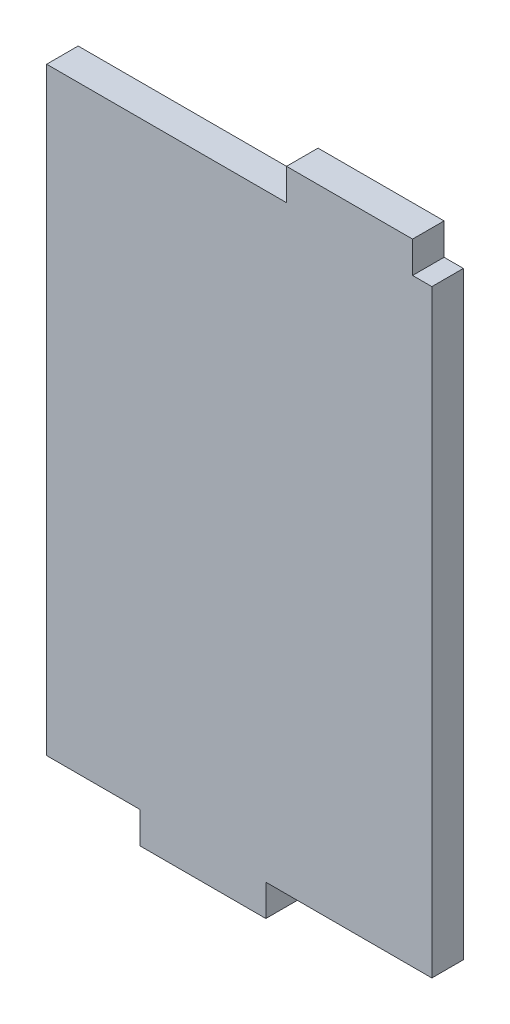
ISO-10303-21;
HEADER;
FILE_DESCRIPTION(('STEP AP214'),'2;1');
FILE_NAME('part.step','',(''),(''),'','','');
FILE_SCHEMA(('AUTOMOTIVE_DESIGN { 1 0 10303 214 1 1 1 1 }'));
ENDSEC;
DATA;
#1=APPLICATION_CONTEXT('core data for automotive mechanical design processes');
#2=APPLICATION_PROTOCOL_DEFINITION('international standard','automotive_design',2000,#1);
#3=PRODUCT_CONTEXT('',#1,'mechanical');
#4=PRODUCT('Part','Part','',(#3));
#5=PRODUCT_RELATED_PRODUCT_CATEGORY('part','',(#4));
#6=PRODUCT_DEFINITION_FORMATION('','',#4);
#7=PRODUCT_DEFINITION_CONTEXT('part definition',#1,'design');
#8=PRODUCT_DEFINITION('design','',#6,#7);
#9=PRODUCT_DEFINITION_SHAPE('','',#8);
#10=(LENGTH_UNIT() NAMED_UNIT(*) SI_UNIT(.MILLI.,.METRE.));
#11=(NAMED_UNIT(*) PLANE_ANGLE_UNIT() SI_UNIT($,.RADIAN.));
#12=(NAMED_UNIT(*) SI_UNIT($,.STERADIAN.) SOLID_ANGLE_UNIT());
#13=UNCERTAINTY_MEASURE_WITH_UNIT(LENGTH_MEASURE(1.E-05),#10,'distance_accuracy_value','');
#14=(GEOMETRIC_REPRESENTATION_CONTEXT(3) GLOBAL_UNCERTAINTY_ASSIGNED_CONTEXT((#13)) GLOBAL_UNIT_ASSIGNED_CONTEXT((#10,
#11,#12)) REPRESENTATION_CONTEXT('',''));
#15=CARTESIAN_POINT('',(0.,0.,0.));
#16=DIRECTION('',(0.,0.,1.));
#17=DIRECTION('',(1.,0.,0.));
#18=AXIS2_PLACEMENT_3D('',#15,#16,#17);
#19=CARTESIAN_POINT('',(68.5,100.,5.));
#20=DIRECTION('',(0.,-1.,0.));
#21=DIRECTION('',(0.,0.,-1.));
#22=AXIS2_PLACEMENT_3D('',#19,#20,#21);
#23=PLANE('',#22);
#24=DIRECTION('',(-1.,0.,0.));
#25=VECTOR('',#24,1.);
#26=CARTESIAN_POINT('',(68.5,100.,0.));
#27=LINE('',#26,#25);
#28=CARTESIAN_POINT('',(106.56,100.,0.));
#29=VERTEX_POINT('',#28);
#30=CARTESIAN_POINT('',(68.5,100.,0.));
#31=VERTEX_POINT('',#30);
#32=EDGE_CURVE('E159',#29,#31,#27,.T.);
#33=ORIENTED_EDGE('',*,*,#32,.T.);
#34=DIRECTION('',(0.,0.,-1.));
#35=VECTOR('',#34,1.);
#36=CARTESIAN_POINT('',(68.5,100.,5.));
#37=LINE('',#36,#35);
#38=CARTESIAN_POINT('',(68.5,100.,5.));
#39=VERTEX_POINT('',#38);
#40=EDGE_CURVE('E11',#39,#31,#37,.T.);
#41=ORIENTED_EDGE('',*,*,#40,.F.);
#42=DIRECTION('',(-1.,0.,0.));
#43=VECTOR('',#42,1.);
#44=CARTESIAN_POINT('',(68.5,100.,5.));
#45=LINE('',#44,#43);
#46=CARTESIAN_POINT('',(106.56,100.,5.));
#47=VERTEX_POINT('',#46);
#48=EDGE_CURVE('E182',#47,#39,#45,.T.);
#49=ORIENTED_EDGE('',*,*,#48,.F.);
#50=DIRECTION('',(0.,0.,-1.));
#51=VECTOR('',#50,1.);
#52=CARTESIAN_POINT('',(106.56,100.,5.));
#53=LINE('',#52,#51);
#54=EDGE_CURVE('E155',#47,#29,#53,.T.);
#55=ORIENTED_EDGE('',*,*,#54,.T.);
#56=EDGE_LOOP('',(#33,#41,#49,#55));
#57=FACE_BOUND('',#56,.T.);
#58=ADVANCED_FACE('F39',(#57),#23,.F.);
#59=CARTESIAN_POINT('',(68.5,5.,5.));
#60=DIRECTION('',(1.,0.,0.));
#61=DIRECTION('',(0.,0.,-1.));
#62=AXIS2_PLACEMENT_3D('',#59,#60,#61);
#63=PLANE('',#62);
#64=DIRECTION('',(0.,-1.,0.));
#65=VECTOR('',#64,1.);
#66=CARTESIAN_POINT('',(68.5,5.,0.));
#67=LINE('',#66,#65);
#68=CARTESIAN_POINT('',(68.5,5.,0.));
#69=VERTEX_POINT('',#68);
#70=EDGE_CURVE('E162',#31,#69,#67,.T.);
#71=ORIENTED_EDGE('',*,*,#70,.T.);
#72=DIRECTION('',(0.,0.,-1.));
#73=VECTOR('',#72,1.);
#74=CARTESIAN_POINT('',(68.5,5.,5.));
#75=LINE('',#74,#73);
#76=CARTESIAN_POINT('',(68.5,5.,5.));
#77=VERTEX_POINT('',#76);
#78=EDGE_CURVE('E47',#77,#69,#75,.T.);
#79=ORIENTED_EDGE('',*,*,#78,.F.);
#80=DIRECTION('',(0.,-1.,0.));
#81=VECTOR('',#80,1.);
#82=CARTESIAN_POINT('',(68.5,5.,5.));
#83=LINE('',#82,#81);
#84=EDGE_CURVE('E110',#39,#77,#83,.T.);
#85=ORIENTED_EDGE('',*,*,#84,.F.);
#86=ORIENTED_EDGE('',*,*,#40,.T.);
#87=EDGE_LOOP('',(#71,#79,#85,#86));
#88=FACE_BOUND('',#87,.T.);
#89=ADVANCED_FACE('F260',(#88),#63,.F.);
#90=CARTESIAN_POINT('',(83.28,5.,5.));
#91=DIRECTION('',(0.,1.,0.));
#92=DIRECTION('',(0.,0.,1.));
#93=AXIS2_PLACEMENT_3D('',#90,#91,#92);
#94=PLANE('',#93);
#95=DIRECTION('',(1.,0.,0.));
#96=VECTOR('',#95,1.);
#97=CARTESIAN_POINT('',(83.28,5.,0.));
#98=LINE('',#97,#96);
#99=CARTESIAN_POINT('',(83.28,5.,0.));
#100=VERTEX_POINT('',#99);
#101=EDGE_CURVE('E164',#69,#100,#98,.T.);
#102=ORIENTED_EDGE('',*,*,#101,.T.);
#103=DIRECTION('',(0.,0.,-1.));
#104=VECTOR('',#103,1.);
#105=CARTESIAN_POINT('',(83.28,5.,5.));
#106=LINE('',#105,#104);
#107=CARTESIAN_POINT('',(83.28,5.,5.));
#108=VERTEX_POINT('',#107);
#109=EDGE_CURVE('E201',#108,#100,#106,.T.);
#110=ORIENTED_EDGE('',*,*,#109,.F.);
#111=DIRECTION('',(1.,0.,0.));
#112=VECTOR('',#111,1.);
#113=CARTESIAN_POINT('',(83.28,5.,5.));
#114=LINE('',#113,#112);
#115=EDGE_CURVE('E209',#77,#108,#114,.T.);
#116=ORIENTED_EDGE('',*,*,#115,.F.);
#117=ORIENTED_EDGE('',*,*,#78,.T.);
#118=EDGE_LOOP('',(#102,#110,#116,#117));
#119=FACE_BOUND('',#118,.T.);
#120=ADVANCED_FACE('F207',(#119),#94,.F.);
#121=CARTESIAN_POINT('',(83.28,5.,5.));
#122=DIRECTION('',(1.,0.,0.));
#123=DIRECTION('',(0.,0.,-1.));
#124=AXIS2_PLACEMENT_3D('',#121,#122,#123);
#125=PLANE('',#124);
#126=DIRECTION('',(0.,-1.,0.));
#127=VECTOR('',#126,1.);
#128=CARTESIAN_POINT('',(83.28,5.,0.));
#129=LINE('',#128,#127);
#130=CARTESIAN_POINT('',(83.28,0.,0.));
#131=VERTEX_POINT('',#130);
#132=EDGE_CURVE('E166',#100,#131,#129,.T.);
#133=ORIENTED_EDGE('',*,*,#132,.T.);
#134=DIRECTION('',(0.,0.,-1.));
#135=VECTOR('',#134,1.);
#136=CARTESIAN_POINT('',(83.28,0.,5.));
#137=LINE('',#136,#135);
#138=CARTESIAN_POINT('',(83.28,0.,5.));
#139=VERTEX_POINT('',#138);
#140=EDGE_CURVE('E198',#139,#131,#137,.T.);
#141=ORIENTED_EDGE('',*,*,#140,.F.);
#142=DIRECTION('',(0.,-1.,0.));
#143=VECTOR('',#142,1.);
#144=CARTESIAN_POINT('',(83.28,5.,5.));
#145=LINE('',#144,#143);
#146=EDGE_CURVE('E227',#108,#139,#145,.T.);
#147=ORIENTED_EDGE('',*,*,#146,.F.);
#148=ORIENTED_EDGE('',*,*,#109,.T.);
#149=EDGE_LOOP('',(#133,#141,#147,#148));
#150=FACE_BOUND('',#149,.T.);
#151=ADVANCED_FACE('F218',(#150),#125,.F.);
#152=CARTESIAN_POINT('',(83.28,0.,5.));
#153=DIRECTION('',(0.,1.,0.));
#154=DIRECTION('',(0.,0.,1.));
#155=AXIS2_PLACEMENT_3D('',#152,#153,#154);
#156=PLANE('',#155);
#157=DIRECTION('',(1.,0.,0.));
#158=VECTOR('',#157,1.);
#159=CARTESIAN_POINT('',(83.28,0.,0.));
#160=LINE('',#159,#158);
#161=CARTESIAN_POINT('',(103.28,0.,0.));
#162=VERTEX_POINT('',#161);
#163=EDGE_CURVE('E168',#131,#162,#160,.T.);
#164=ORIENTED_EDGE('',*,*,#163,.T.);
#165=DIRECTION('',(0.,0.,-1.));
#166=VECTOR('',#165,1.);
#167=CARTESIAN_POINT('',(103.28,0.,5.));
#168=LINE('',#167,#166);
#169=CARTESIAN_POINT('',(103.28,0.,5.));
#170=VERTEX_POINT('',#169);
#171=EDGE_CURVE('E195',#170,#162,#168,.T.);
#172=ORIENTED_EDGE('',*,*,#171,.F.);
#173=DIRECTION('',(1.,0.,0.));
#174=VECTOR('',#173,1.);
#175=CARTESIAN_POINT('',(83.28,0.,5.));
#176=LINE('',#175,#174);
#177=EDGE_CURVE('E224',#139,#170,#176,.T.);
#178=ORIENTED_EDGE('',*,*,#177,.F.);
#179=ORIENTED_EDGE('',*,*,#140,.T.);
#180=EDGE_LOOP('',(#164,#172,#178,#179));
#181=FACE_BOUND('',#180,.T.);
#182=ADVANCED_FACE('F222',(#181),#156,.F.);
#183=CARTESIAN_POINT('',(103.28,0.,5.));
#184=DIRECTION('',(-1.,0.,0.));
#185=DIRECTION('',(0.,0.,1.));
#186=AXIS2_PLACEMENT_3D('',#183,#184,#185);
#187=PLANE('',#186);
#188=DIRECTION('',(0.,1.,0.));
#189=VECTOR('',#188,1.);
#190=CARTESIAN_POINT('',(103.28,0.,0.));
#191=LINE('',#190,#189);
#192=CARTESIAN_POINT('',(103.28,5.,0.));
#193=VERTEX_POINT('',#192);
#194=EDGE_CURVE('E170',#162,#193,#191,.T.);
#195=ORIENTED_EDGE('',*,*,#194,.T.);
#196=DIRECTION('',(0.,0.,-1.));
#197=VECTOR('',#196,1.);
#198=CARTESIAN_POINT('',(103.28,5.,5.));
#199=LINE('',#198,#197);
#200=CARTESIAN_POINT('',(103.28,5.,5.));
#201=VERTEX_POINT('',#200);
#202=EDGE_CURVE('E192',#201,#193,#199,.T.);
#203=ORIENTED_EDGE('',*,*,#202,.F.);
#204=DIRECTION('',(0.,1.,0.));
#205=VECTOR('',#204,1.);
#206=CARTESIAN_POINT('',(103.28,0.,5.));
#207=LINE('',#206,#205);
#208=EDGE_CURVE('E226',#170,#201,#207,.T.);
#209=ORIENTED_EDGE('',*,*,#208,.F.);
#210=ORIENTED_EDGE('',*,*,#171,.T.);
#211=EDGE_LOOP('',(#195,#203,#209,#210));
#212=FACE_BOUND('',#211,.T.);
#213=ADVANCED_FACE('F273',(#212),#187,.F.);
#214=CARTESIAN_POINT('',(126.56,5.,5.));
#215=DIRECTION('',(0.,1.,0.));
#216=DIRECTION('',(-1.,0.,0.));
#217=AXIS2_PLACEMENT_3D('',#214,#215,#216);
#218=PLANE('',#217);
#219=DIRECTION('',(1.,0.,0.));
#220=VECTOR('',#219,1.);
#221=CARTESIAN_POINT('',(126.56,5.,0.));
#222=LINE('',#221,#220);
#223=CARTESIAN_POINT('',(129.62,5.,0.));
#224=VERTEX_POINT('',#223);
#225=EDGE_CURVE('E173',#193,#224,#222,.T.);
#226=ORIENTED_EDGE('',*,*,#225,.T.);
#227=DIRECTION('',(0.,0.,-1.));
#228=VECTOR('',#227,1.);
#229=CARTESIAN_POINT('',(129.62,5.,5.));
#230=LINE('',#229,#228);
#231=CARTESIAN_POINT('',(129.62,5.,5.));
#232=VERTEX_POINT('',#231);
#233=EDGE_CURVE('E189',#232,#224,#230,.T.);
#234=ORIENTED_EDGE('',*,*,#233,.F.);
#235=DIRECTION('',(1.,0.,0.));
#236=VECTOR('',#235,1.);
#237=CARTESIAN_POINT('',(103.28,5.,5.));
#238=LINE('',#237,#236);
#239=EDGE_CURVE('E229',#201,#232,#238,.T.);
#240=ORIENTED_EDGE('',*,*,#239,.F.);
#241=ORIENTED_EDGE('',*,*,#202,.T.);
#242=EDGE_LOOP('',(#226,#234,#240,#241));
#243=FACE_BOUND('',#242,.T.);
#244=ADVANCED_FACE('F276',(#243),#218,.F.);
#245=CARTESIAN_POINT('',(129.62,5.,5.));
#246=DIRECTION('',(-1.,0.,0.));
#247=DIRECTION('',(0.,0.,1.));
#248=AXIS2_PLACEMENT_3D('',#245,#246,#247);
#249=PLANE('',#248);
#250=DIRECTION('',(0.,1.,0.));
#251=VECTOR('',#250,1.);
#252=CARTESIAN_POINT('',(129.62,5.,0.));
#253=LINE('',#252,#251);
#254=CARTESIAN_POINT('',(129.62,100.,0.));
#255=VERTEX_POINT('',#254);
#256=EDGE_CURVE('E175',#224,#255,#253,.T.);
#257=ORIENTED_EDGE('',*,*,#256,.T.);
#258=DIRECTION('',(0.,0.,-1.));
#259=VECTOR('',#258,1.);
#260=CARTESIAN_POINT('',(129.62,100.,5.));
#261=LINE('',#260,#259);
#262=CARTESIAN_POINT('',(129.62,100.,5.));
#263=VERTEX_POINT('',#262);
#264=EDGE_CURVE('E186',#263,#255,#261,.T.);
#265=ORIENTED_EDGE('',*,*,#264,.F.);
#266=DIRECTION('',(0.,1.,0.));
#267=VECTOR('',#266,1.);
#268=CARTESIAN_POINT('',(129.62,5.,5.));
#269=LINE('',#268,#267);
#270=EDGE_CURVE('E235',#232,#263,#269,.T.);
#271=ORIENTED_EDGE('',*,*,#270,.F.);
#272=ORIENTED_EDGE('',*,*,#233,.T.);
#273=EDGE_LOOP('',(#257,#265,#271,#272));
#274=FACE_BOUND('',#273,.T.);
#275=ADVANCED_FACE('F241',(#274),#249,.F.);
#276=CARTESIAN_POINT('',(126.56,100.,5.));
#277=DIRECTION('',(0.,-1.,0.));
#278=DIRECTION('',(0.,0.,-1.));
#279=AXIS2_PLACEMENT_3D('',#276,#277,#278);
#280=PLANE('',#279);
#281=DIRECTION('',(-1.,0.,0.));
#282=VECTOR('',#281,1.);
#283=CARTESIAN_POINT('',(126.56,100.,0.));
#284=LINE('',#283,#282);
#285=CARTESIAN_POINT('',(126.56,100.,0.));
#286=VERTEX_POINT('',#285);
#287=EDGE_CURVE('E177',#255,#286,#284,.T.);
#288=ORIENTED_EDGE('',*,*,#287,.T.);
#289=DIRECTION('',(0.,0.,-1.));
#290=VECTOR('',#289,1.);
#291=CARTESIAN_POINT('',(126.56,100.,5.));
#292=LINE('',#291,#290);
#293=CARTESIAN_POINT('',(126.56,100.,5.));
#294=VERTEX_POINT('',#293);
#295=EDGE_CURVE('E150',#294,#286,#292,.T.);
#296=ORIENTED_EDGE('',*,*,#295,.F.);
#297=DIRECTION('',(-1.,0.,0.));
#298=VECTOR('',#297,1.);
#299=CARTESIAN_POINT('',(126.56,100.,5.));
#300=LINE('',#299,#298);
#301=EDGE_CURVE('E141',#263,#294,#300,.T.);
#302=ORIENTED_EDGE('',*,*,#301,.F.);
#303=ORIENTED_EDGE('',*,*,#264,.T.);
#304=EDGE_LOOP('',(#288,#296,#302,#303));
#305=FACE_BOUND('',#304,.T.);
#306=ADVANCED_FACE('F245',(#305),#280,.F.);
#307=CARTESIAN_POINT('',(126.56,105.,5.));
#308=DIRECTION('',(-1.,0.,0.));
#309=DIRECTION('',(0.,0.,1.));
#310=AXIS2_PLACEMENT_3D('',#307,#308,#309);
#311=PLANE('',#310);
#312=DIRECTION('',(0.,1.,0.));
#313=VECTOR('',#312,1.);
#314=CARTESIAN_POINT('',(126.56,105.,0.));
#315=LINE('',#314,#313);
#316=CARTESIAN_POINT('',(126.56,105.,0.));
#317=VERTEX_POINT('',#316);
#318=EDGE_CURVE('E149',#286,#317,#315,.T.);
#319=ORIENTED_EDGE('',*,*,#318,.T.);
#320=DIRECTION('',(0.,0.,-1.));
#321=VECTOR('',#320,1.);
#322=CARTESIAN_POINT('',(126.56,105.,5.));
#323=LINE('',#322,#321);
#324=CARTESIAN_POINT('',(126.56,105.,5.));
#325=VERTEX_POINT('',#324);
#326=EDGE_CURVE('E146',#325,#317,#323,.T.);
#327=ORIENTED_EDGE('',*,*,#326,.F.);
#328=DIRECTION('',(0.,1.,0.));
#329=VECTOR('',#328,1.);
#330=CARTESIAN_POINT('',(126.56,105.,5.));
#331=LINE('',#330,#329);
#332=EDGE_CURVE('E135',#294,#325,#331,.T.);
#333=ORIENTED_EDGE('',*,*,#332,.F.);
#334=ORIENTED_EDGE('',*,*,#295,.T.);
#335=EDGE_LOOP('',(#319,#327,#333,#334));
#336=FACE_BOUND('',#335,.T.);
#337=ADVANCED_FACE('F147',(#336),#311,.F.);
#338=CARTESIAN_POINT('',(106.56,105.,5.));
#339=DIRECTION('',(0.,-1.,0.));
#340=DIRECTION('',(0.,0.,-1.));
#341=AXIS2_PLACEMENT_3D('',#338,#339,#340);
#342=PLANE('',#341);
#343=DIRECTION('',(-1.,0.,0.));
#344=VECTOR('',#343,1.);
#345=CARTESIAN_POINT('',(106.56,105.,0.));
#346=LINE('',#345,#344);
#347=CARTESIAN_POINT('',(106.56,105.,0.));
#348=VERTEX_POINT('',#347);
#349=EDGE_CURVE('E96',#317,#348,#346,.T.);
#350=ORIENTED_EDGE('',*,*,#349,.T.);
#351=DIRECTION('',(0.,0.,-1.));
#352=VECTOR('',#351,1.);
#353=CARTESIAN_POINT('',(106.56,105.,5.));
#354=LINE('',#353,#352);
#355=CARTESIAN_POINT('',(106.56,105.,5.));
#356=VERTEX_POINT('',#355);
#357=EDGE_CURVE('E151',#356,#348,#354,.T.);
#358=ORIENTED_EDGE('',*,*,#357,.F.);
#359=DIRECTION('',(-1.,0.,0.));
#360=VECTOR('',#359,1.);
#361=CARTESIAN_POINT('',(106.56,105.,5.));
#362=LINE('',#361,#360);
#363=EDGE_CURVE('E139',#325,#356,#362,.T.);
#364=ORIENTED_EDGE('',*,*,#363,.F.);
#365=ORIENTED_EDGE('',*,*,#326,.T.);
#366=EDGE_LOOP('',(#350,#358,#364,#365));
#367=FACE_BOUND('',#366,.T.);
#368=ADVANCED_FACE('F153',(#367),#342,.F.);
#369=CARTESIAN_POINT('',(106.56,100.,5.));
#370=DIRECTION('',(1.,0.,0.));
#371=DIRECTION('',(0.,0.,-1.));
#372=AXIS2_PLACEMENT_3D('',#369,#370,#371);
#373=PLANE('',#372);
#374=DIRECTION('',(0.,-1.,0.));
#375=VECTOR('',#374,1.);
#376=CARTESIAN_POINT('',(106.56,100.,0.));
#377=LINE('',#376,#375);
#378=EDGE_CURVE('E102',#348,#29,#377,.T.);
#379=ORIENTED_EDGE('',*,*,#378,.T.);
#380=ORIENTED_EDGE('',*,*,#54,.F.);
#381=DIRECTION('',(0.,-1.,0.));
#382=VECTOR('',#381,1.);
#383=CARTESIAN_POINT('',(106.56,100.,5.));
#384=LINE('',#383,#382);
#385=EDGE_CURVE('E55',#356,#47,#384,.T.);
#386=ORIENTED_EDGE('',*,*,#385,.F.);
#387=ORIENTED_EDGE('',*,*,#357,.T.);
#388=EDGE_LOOP('',(#379,#380,#386,#387));
#389=FACE_BOUND('',#388,.T.);
#390=ADVANCED_FACE('F249',(#389),#373,.F.);
#391=CARTESIAN_POINT('',(0.,0.,5.));
#392=DIRECTION('',(0.,0.,1.));
#393=DIRECTION('',(1.,0.,0.));
#394=AXIS2_PLACEMENT_3D('',#391,#392,#393);
#395=PLANE('',#394);
#396=ORIENTED_EDGE('',*,*,#48,.T.);
#397=ORIENTED_EDGE('',*,*,#84,.T.);
#398=ORIENTED_EDGE('',*,*,#115,.T.);
#399=ORIENTED_EDGE('',*,*,#146,.T.);
#400=ORIENTED_EDGE('',*,*,#177,.T.);
#401=ORIENTED_EDGE('',*,*,#208,.T.);
#402=ORIENTED_EDGE('',*,*,#239,.T.);
#403=ORIENTED_EDGE('',*,*,#270,.T.);
#404=ORIENTED_EDGE('',*,*,#301,.T.);
#405=ORIENTED_EDGE('',*,*,#332,.T.);
#406=ORIENTED_EDGE('',*,*,#363,.T.);
#407=ORIENTED_EDGE('',*,*,#385,.T.);
#408=EDGE_LOOP('',(#396,#397,#398,#399,#400,#401,#402,#403,#404,#405,#406,#407));
#409=FACE_BOUND('',#408,.T.);
#410=ADVANCED_FACE('F137',(#409),#395,.T.);
#411=CARTESIAN_POINT('',(0.,0.,0.));
#412=DIRECTION('',(0.,0.,1.));
#413=DIRECTION('',(1.,0.,0.));
#414=AXIS2_PLACEMENT_3D('',#411,#412,#413);
#415=PLANE('',#414);
#416=ORIENTED_EDGE('',*,*,#32,.F.);
#417=ORIENTED_EDGE('',*,*,#378,.F.);
#418=ORIENTED_EDGE('',*,*,#349,.F.);
#419=ORIENTED_EDGE('',*,*,#318,.F.);
#420=ORIENTED_EDGE('',*,*,#287,.F.);
#421=ORIENTED_EDGE('',*,*,#256,.F.);
#422=ORIENTED_EDGE('',*,*,#225,.F.);
#423=ORIENTED_EDGE('',*,*,#194,.F.);
#424=ORIENTED_EDGE('',*,*,#163,.F.);
#425=ORIENTED_EDGE('',*,*,#132,.F.);
#426=ORIENTED_EDGE('',*,*,#101,.F.);
#427=ORIENTED_EDGE('',*,*,#70,.F.);
#428=EDGE_LOOP('',(#416,#417,#418,#419,#420,#421,#422,#423,#424,#425,#426,#427));
#429=FACE_BOUND('',#428,.T.);
#430=ADVANCED_FACE('F213',(#429),#415,.F.);
#431=CLOSED_SHELL('',(#58,#89,#120,#151,#182,#213,#244,#275,#306,#337,#368,#390,#410,#430));
#432=MANIFOLD_SOLID_BREP('B2',#431);
#433=ADVANCED_BREP_SHAPE_REPRESENTATION('',(#18,#432),#14);
#434=SHAPE_DEFINITION_REPRESENTATION(#9,#433);
ENDSEC;
END-ISO-10303-21;
